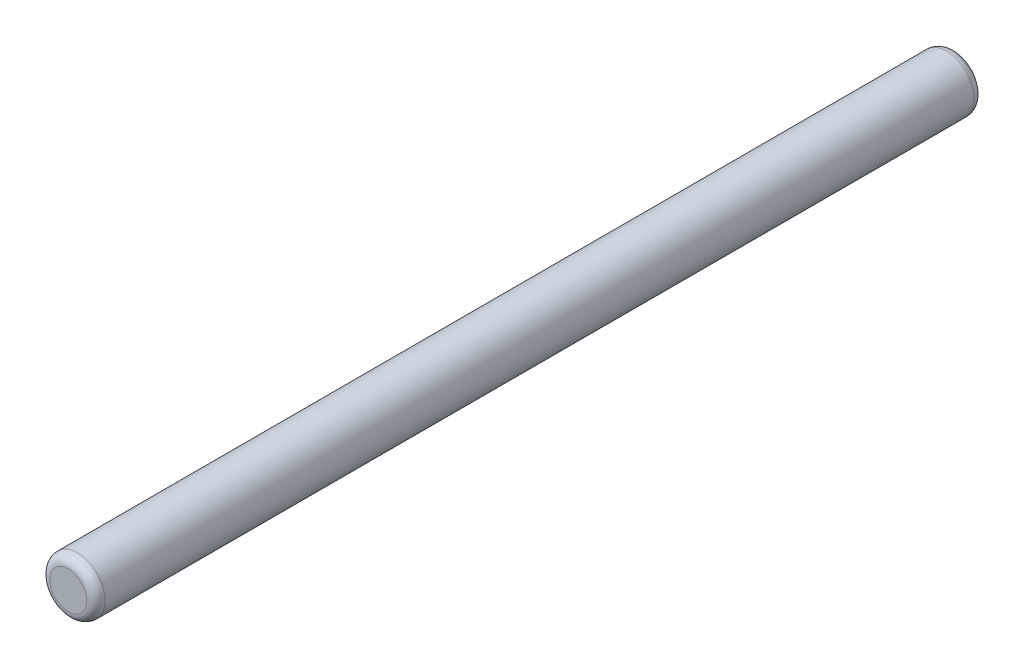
ISO-10303-21;
HEADER;
FILE_DESCRIPTION(('STEP AP214'),'2;1');
FILE_NAME('part.step','',(''),(''),'','','');
FILE_SCHEMA(('AUTOMOTIVE_DESIGN { 1 0 10303 214 1 1 1 1 }'));
ENDSEC;
DATA;
#1=APPLICATION_CONTEXT('core data for automotive mechanical design processes');
#2=APPLICATION_PROTOCOL_DEFINITION('international standard','automotive_design',2000,#1);
#3=PRODUCT_CONTEXT('',#1,'mechanical');
#4=PRODUCT('Part','Part','',(#3));
#5=PRODUCT_RELATED_PRODUCT_CATEGORY('part','',(#4));
#6=PRODUCT_DEFINITION_FORMATION('','',#4);
#7=PRODUCT_DEFINITION_CONTEXT('part definition',#1,'design');
#8=PRODUCT_DEFINITION('design','',#6,#7);
#9=PRODUCT_DEFINITION_SHAPE('','',#8);
#10=(LENGTH_UNIT() NAMED_UNIT(*) SI_UNIT(.MILLI.,.METRE.));
#11=(NAMED_UNIT(*) PLANE_ANGLE_UNIT() SI_UNIT($,.RADIAN.));
#12=(NAMED_UNIT(*) SI_UNIT($,.STERADIAN.) SOLID_ANGLE_UNIT());
#13=UNCERTAINTY_MEASURE_WITH_UNIT(LENGTH_MEASURE(1.E-05),#10,'distance_accuracy_value','');
#14=(GEOMETRIC_REPRESENTATION_CONTEXT(3) GLOBAL_UNCERTAINTY_ASSIGNED_CONTEXT((#13)) GLOBAL_UNIT_ASSIGNED_CONTEXT((#10,
#11,#12)) REPRESENTATION_CONTEXT('',''));
#15=CARTESIAN_POINT('',(0.,0.,0.));
#16=DIRECTION('',(0.,0.,1.));
#17=DIRECTION('',(1.,0.,0.));
#18=AXIS2_PLACEMENT_3D('',#15,#16,#17);
#19=CARTESIAN_POINT('',(0.,0.,48.));
#20=DIRECTION('',(0.,0.,-1.));
#21=DIRECTION('',(-1.,0.,0.));
#22=AXIS2_PLACEMENT_3D('',#19,#20,#21);
#23=CYLINDRICAL_SURFACE('',#22,1.5);
#24=CARTESIAN_POINT('',(0.,0.,0.5));
#25=DIRECTION('',(0.,0.,1.));
#26=DIRECTION('',(1.,0.,0.));
#27=AXIS2_PLACEMENT_3D('',#24,#25,#26);
#28=CIRCLE('',#27,1.5);
#29=CARTESIAN_POINT('',(1.5,0.,0.5));
#30=VERTEX_POINT('',#29);
#31=EDGE_CURVE('E42',#30,#30,#28,.T.);
#32=ORIENTED_EDGE('',*,*,#31,.T.);
#33=EDGE_LOOP('',(#32));
#34=FACE_BOUND('',#33,.T.);
#35=CARTESIAN_POINT('',(0.,0.,47.5));
#36=DIRECTION('',(0.,0.,1.));
#37=DIRECTION('',(1.,0.,0.));
#38=AXIS2_PLACEMENT_3D('',#35,#36,#37);
#39=CIRCLE('',#38,1.5);
#40=CARTESIAN_POINT('',(1.5,0.,47.5));
#41=VERTEX_POINT('',#40);
#42=EDGE_CURVE('E48',#41,#41,#39,.F.);
#43=ORIENTED_EDGE('',*,*,#42,.T.);
#44=EDGE_LOOP('',(#43));
#45=FACE_BOUND('',#44,.T.);
#46=ADVANCED_FACE('F31',(#34,#45),#23,.T.);
#47=CARTESIAN_POINT('',(0.,0.,48.));
#48=DIRECTION('',(0.,0.,1.));
#49=DIRECTION('',(1.,0.,0.));
#50=AXIS2_PLACEMENT_3D('',#47,#48,#49);
#51=PLANE('',#50);
#52=CARTESIAN_POINT('',(0.,0.,48.));
#53=DIRECTION('',(0.,0.,1.));
#54=DIRECTION('',(1.,0.,0.));
#55=AXIS2_PLACEMENT_3D('',#52,#53,#54);
#56=CIRCLE('',#55,1.);
#57=CARTESIAN_POINT('',(1.,0.,48.));
#58=VERTEX_POINT('',#57);
#59=EDGE_CURVE('E10',#58,#58,#56,.T.);
#60=ORIENTED_EDGE('',*,*,#59,.T.);
#61=EDGE_LOOP('',(#60));
#62=FACE_BOUND('',#61,.T.);
#63=ADVANCED_FACE('F67',(#62),#51,.T.);
#64=CARTESIAN_POINT('',(0.,0.,0.));
#65=DIRECTION('',(0.,0.,1.));
#66=DIRECTION('',(1.,0.,0.));
#67=AXIS2_PLACEMENT_3D('',#64,#65,#66);
#68=PLANE('',#67);
#69=CARTESIAN_POINT('',(0.,0.,0.));
#70=DIRECTION('',(0.,0.,1.));
#71=DIRECTION('',(1.,0.,0.));
#72=AXIS2_PLACEMENT_3D('',#69,#70,#71);
#73=CIRCLE('',#72,1.);
#74=CARTESIAN_POINT('',(1.,0.,0.));
#75=VERTEX_POINT('',#74);
#76=EDGE_CURVE('E37',#75,#75,#73,.F.);
#77=ORIENTED_EDGE('',*,*,#76,.T.);
#78=EDGE_LOOP('',(#77));
#79=FACE_BOUND('',#78,.T.);
#80=ADVANCED_FACE('F63',(#79),#68,.F.);
#81=CARTESIAN_POINT('',(0.,0.,0.5));
#82=DIRECTION('',(0.,0.,1.));
#83=DIRECTION('',(1.,0.,0.));
#84=AXIS2_PLACEMENT_3D('',#81,#82,#83);
#85=TOROIDAL_SURFACE('',#84,1.,0.5);
#86=ORIENTED_EDGE('',*,*,#76,.F.);
#87=EDGE_LOOP('',(#86));
#88=FACE_BOUND('',#87,.T.);
#89=ORIENTED_EDGE('',*,*,#31,.F.);
#90=EDGE_LOOP('',(#89));
#91=FACE_BOUND('',#90,.T.);
#92=ADVANCED_FACE('F58',(#88,#91),#85,.T.);
#93=CARTESIAN_POINT('',(0.,0.,47.5));
#94=DIRECTION('',(0.,0.,1.));
#95=DIRECTION('',(1.,0.,0.));
#96=AXIS2_PLACEMENT_3D('',#93,#94,#95);
#97=TOROIDAL_SURFACE('',#96,1.,0.5);
#98=ORIENTED_EDGE('',*,*,#42,.F.);
#99=EDGE_LOOP('',(#98));
#100=FACE_BOUND('',#99,.T.);
#101=ORIENTED_EDGE('',*,*,#59,.F.);
#102=EDGE_LOOP('',(#101));
#103=FACE_BOUND('',#102,.T.);
#104=ADVANCED_FACE('F55',(#100,#103),#97,.T.);
#105=CLOSED_SHELL('',(#46,#63,#80,#92,#104));
#106=MANIFOLD_SOLID_BREP('B2',#105);
#107=ADVANCED_BREP_SHAPE_REPRESENTATION('',(#18,#106),#14);
#108=SHAPE_DEFINITION_REPRESENTATION(#9,#107);
ENDSEC;
END-ISO-10303-21;
